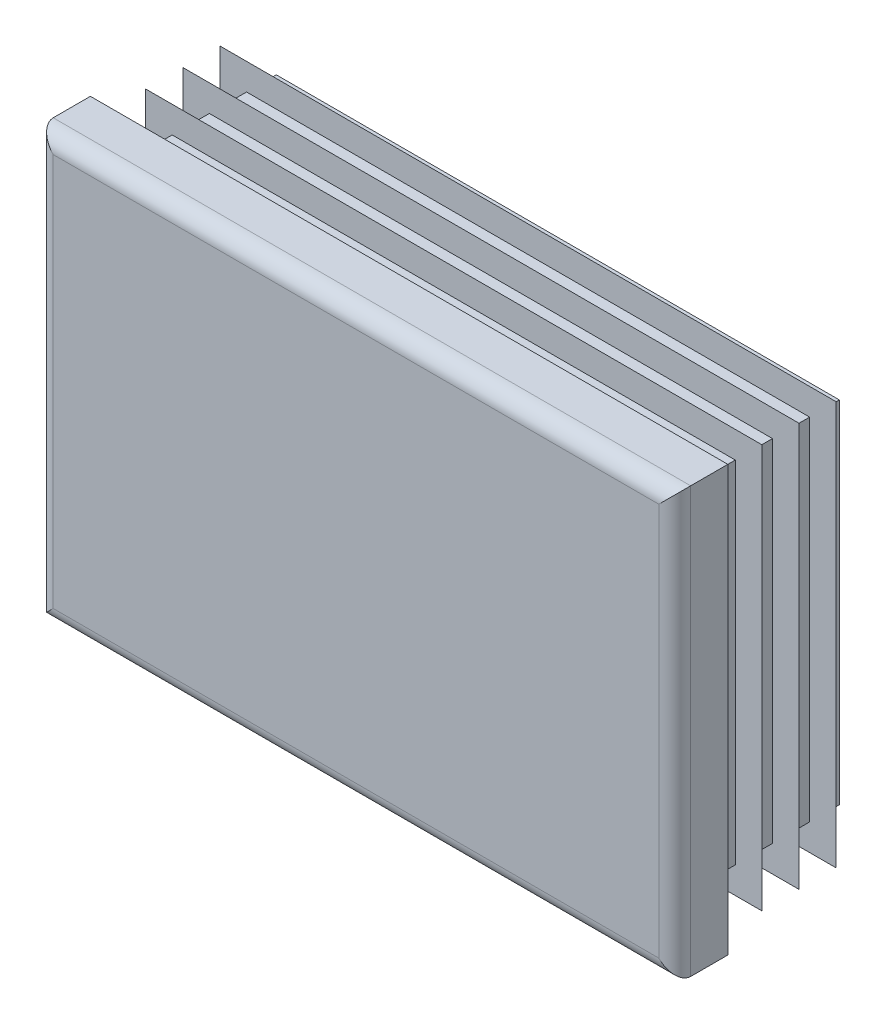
ISO-10303-21;
HEADER;
FILE_DESCRIPTION(('STEP AP214'),'2;1');
FILE_NAME('part.step','',(''),(''),'','','');
FILE_SCHEMA(('AUTOMOTIVE_DESIGN { 1 0 10303 214 1 1 1 1 }'));
ENDSEC;
DATA;
#1=APPLICATION_CONTEXT('core data for automotive mechanical design processes');
#2=APPLICATION_PROTOCOL_DEFINITION('international standard','automotive_design',2000,#1);
#3=PRODUCT_CONTEXT('',#1,'mechanical');
#4=PRODUCT('Part','Part','',(#3));
#5=PRODUCT_RELATED_PRODUCT_CATEGORY('part','',(#4));
#6=PRODUCT_DEFINITION_FORMATION('','',#4);
#7=PRODUCT_DEFINITION_CONTEXT('part definition',#1,'design');
#8=PRODUCT_DEFINITION('design','',#6,#7);
#9=PRODUCT_DEFINITION_SHAPE('','',#8);
#10=(LENGTH_UNIT() NAMED_UNIT(*) SI_UNIT(.MILLI.,.METRE.));
#11=(NAMED_UNIT(*) PLANE_ANGLE_UNIT() SI_UNIT($,.RADIAN.));
#12=(NAMED_UNIT(*) SI_UNIT($,.STERADIAN.) SOLID_ANGLE_UNIT());
#13=UNCERTAINTY_MEASURE_WITH_UNIT(LENGTH_MEASURE(1.E-05),#10,'distance_accuracy_value','');
#14=(GEOMETRIC_REPRESENTATION_CONTEXT(3) GLOBAL_UNCERTAINTY_ASSIGNED_CONTEXT((#13)) GLOBAL_UNIT_ASSIGNED_CONTEXT((#10,
#11,#12)) REPRESENTATION_CONTEXT('',''));
#15=CARTESIAN_POINT('',(0.,0.,0.));
#16=DIRECTION('',(0.,0.,1.));
#17=DIRECTION('',(1.,0.,0.));
#18=AXIS2_PLACEMENT_3D('',#15,#16,#17);
#19=CARTESIAN_POINT('',(28.5,-20.,5.));
#20=DIRECTION('',(0.,0.,-1.));
#21=DIRECTION('',(0.,1.,0.));
#22=AXIS2_PLACEMENT_3D('',#19,#20,#21);
#23=PLANE('',#22);
#24=DIRECTION('',(0.,1.,0.));
#25=VECTOR('',#24,1.);
#26=CARTESIAN_POINT('',(-28.5,-20.,5.));
#27=LINE('',#26,#25);
#28=CARTESIAN_POINT('',(-28.5,-18.5,5.));
#29=VERTEX_POINT('',#28);
#30=CARTESIAN_POINT('',(-28.5,18.5,5.));
#31=VERTEX_POINT('',#30);
#32=EDGE_CURVE('E310',#29,#31,#27,.T.);
#33=ORIENTED_EDGE('',*,*,#32,.F.);
#34=DIRECTION('',(-1.,0.,0.));
#35=VECTOR('',#34,1.);
#36=CARTESIAN_POINT('',(30.,-18.5,5.));
#37=LINE('',#36,#35);
#38=CARTESIAN_POINT('',(28.5,-18.5,5.));
#39=VERTEX_POINT('',#38);
#40=EDGE_CURVE('E482',#39,#29,#37,.T.);
#41=ORIENTED_EDGE('',*,*,#40,.F.);
#42=DIRECTION('',(0.,1.,0.));
#43=VECTOR('',#42,1.);
#44=CARTESIAN_POINT('',(28.5,-20.,5.));
#45=LINE('',#44,#43);
#46=CARTESIAN_POINT('',(28.5,18.5,5.));
#47=VERTEX_POINT('',#46);
#48=EDGE_CURVE('E305',#39,#47,#45,.T.);
#49=ORIENTED_EDGE('',*,*,#48,.T.);
#50=DIRECTION('',(-1.,0.,0.));
#51=VECTOR('',#50,1.);
#52=CARTESIAN_POINT('',(30.,18.5,5.));
#53=LINE('',#52,#51);
#54=EDGE_CURVE('E630',#47,#31,#53,.T.);
#55=ORIENTED_EDGE('',*,*,#54,.T.);
#56=EDGE_LOOP('',(#33,#41,#49,#55));
#57=FACE_BOUND('',#56,.T.);
#58=ADVANCED_FACE('F14',(#57),#23,.F.);
#59=CARTESIAN_POINT('',(-28.5,-20.,3.5));
#60=DIRECTION('',(0.,1.,0.));
#61=DIRECTION('',(-1.,0.,0.));
#62=AXIS2_PLACEMENT_3D('',#59,#60,#61);
#63=CYLINDRICAL_SURFACE('',#62,1.5);
#64=DIRECTION('',(0.,1.,0.));
#65=VECTOR('',#64,1.);
#66=CARTESIAN_POINT('',(-30.,-20.,3.5));
#67=LINE('',#66,#65);
#68=CARTESIAN_POINT('',(-30.,-20.,3.5));
#69=VERTEX_POINT('',#68);
#70=CARTESIAN_POINT('',(-30.,20.,3.5));
#71=VERTEX_POINT('',#70);
#72=EDGE_CURVE('E402',#69,#71,#67,.T.);
#73=ORIENTED_EDGE('',*,*,#72,.F.);
#74=CARTESIAN_POINT('',(-28.5,-18.5,3.5));
#75=DIRECTION('',(-0.707106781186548,0.707106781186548,0.));
#76=DIRECTION('',(0.707106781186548,0.707106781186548,0.));
#77=AXIS2_PLACEMENT_3D('',#74,#75,#76);
#78=ELLIPSE('',#77,2.12132034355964,1.5);
#79=EDGE_CURVE('E59',#69,#29,#78,.T.);
#80=ORIENTED_EDGE('',*,*,#79,.T.);
#81=ORIENTED_EDGE('',*,*,#32,.T.);
#82=CARTESIAN_POINT('',(-28.5,18.5,3.5));
#83=DIRECTION('',(0.707106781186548,0.707106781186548,0.));
#84=DIRECTION('',(-0.707106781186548,0.707106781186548,0.));
#85=AXIS2_PLACEMENT_3D('',#82,#83,#84);
#86=ELLIPSE('',#85,2.12132034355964,1.5);
#87=EDGE_CURVE('E306',#31,#71,#86,.F.);
#88=ORIENTED_EDGE('',*,*,#87,.T.);
#89=EDGE_LOOP('',(#73,#80,#81,#88));
#90=FACE_BOUND('',#89,.T.);
#91=ADVANCED_FACE('F16',(#90),#63,.T.);
#92=CARTESIAN_POINT('',(-30.,-20.,3.5));
#93=DIRECTION('',(1.,0.,0.));
#94=DIRECTION('',(0.,1.,0.));
#95=AXIS2_PLACEMENT_3D('',#92,#93,#94);
#96=PLANE('',#95);
#97=DIRECTION('',(0.,0.,-1.));
#98=VECTOR('',#97,1.);
#99=CARTESIAN_POINT('',(-30.,20.,3.5));
#100=LINE('',#99,#98);
#101=CARTESIAN_POINT('',(-30.,20.,0.));
#102=VERTEX_POINT('',#101);
#103=EDGE_CURVE('E615',#71,#102,#100,.T.);
#104=ORIENTED_EDGE('',*,*,#103,.T.);
#105=DIRECTION('',(0.,1.,0.));
#106=VECTOR('',#105,1.);
#107=CARTESIAN_POINT('',(-30.,-20.,0.));
#108=LINE('',#107,#106);
#109=CARTESIAN_POINT('',(-30.,-20.,0.));
#110=VERTEX_POINT('',#109);
#111=EDGE_CURVE('E400',#110,#102,#108,.T.);
#112=ORIENTED_EDGE('',*,*,#111,.F.);
#113=DIRECTION('',(0.,0.,-1.));
#114=VECTOR('',#113,1.);
#115=CARTESIAN_POINT('',(-30.,-20.,3.5));
#116=LINE('',#115,#114);
#117=EDGE_CURVE('E616',#69,#110,#116,.T.);
#118=ORIENTED_EDGE('',*,*,#117,.F.);
#119=ORIENTED_EDGE('',*,*,#72,.T.);
#120=EDGE_LOOP('',(#104,#112,#118,#119));
#121=FACE_BOUND('',#120,.T.);
#122=ADVANCED_FACE('F697',(#121),#96,.F.);
#123=CARTESIAN_POINT('',(-26.5,-20.,0.));
#124=DIRECTION('',(1.,0.,0.));
#125=DIRECTION('',(0.,1.,0.));
#126=AXIS2_PLACEMENT_3D('',#123,#124,#125);
#127=PLANE('',#126);
#128=DIRECTION('',(0.,1.,0.));
#129=VECTOR('',#128,1.);
#130=CARTESIAN_POINT('',(-26.5,-20.,0.));
#131=LINE('',#130,#129);
#132=CARTESIAN_POINT('',(-26.5,-16.5,0.));
#133=VERTEX_POINT('',#132);
#134=CARTESIAN_POINT('',(-26.5,16.5,0.));
#135=VERTEX_POINT('',#134);
#136=EDGE_CURVE('E397',#133,#135,#131,.T.);
#137=ORIENTED_EDGE('',*,*,#136,.T.);
#138=DIRECTION('',(0.,0.,-1.));
#139=VECTOR('',#138,1.);
#140=CARTESIAN_POINT('',(-26.5,16.5,0.));
#141=LINE('',#140,#139);
#142=CARTESIAN_POINT('',(-26.5,16.5,-0.7));
#143=VERTEX_POINT('',#142);
#144=EDGE_CURVE('E495',#135,#143,#141,.T.);
#145=ORIENTED_EDGE('',*,*,#144,.T.);
#146=DIRECTION('',(0.,1.,0.));
#147=VECTOR('',#146,1.);
#148=CARTESIAN_POINT('',(-26.5,-20.,-0.7));
#149=LINE('',#148,#147);
#150=CARTESIAN_POINT('',(-26.5,-16.5,-0.7));
#151=VERTEX_POINT('',#150);
#152=EDGE_CURVE('E394',#151,#143,#149,.T.);
#153=ORIENTED_EDGE('',*,*,#152,.F.);
#154=DIRECTION('',(0.,0.,1.));
#155=VECTOR('',#154,1.);
#156=CARTESIAN_POINT('',(-26.5,-16.5,0.));
#157=LINE('',#156,#155);
#158=EDGE_CURVE('E489',#151,#133,#157,.T.);
#159=ORIENTED_EDGE('',*,*,#158,.T.);
#160=EDGE_LOOP('',(#137,#145,#153,#159));
#161=FACE_BOUND('',#160,.T.);
#162=ADVANCED_FACE('F787',(#161),#127,.F.);
#163=CARTESIAN_POINT('',(-29.,-20.,-0.7));
#164=DIRECTION('',(0.342020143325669,0.,0.939692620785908));
#165=DIRECTION('',(-0.939692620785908,0.,0.342020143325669));
#166=AXIS2_PLACEMENT_3D('',#163,#164,#165);
#167=PLANE('',#166);
#168=DIRECTION('',(0.,1.,0.));
#169=VECTOR('',#168,1.);
#170=CARTESIAN_POINT('',(-29.,-20.,-0.7));
#171=LINE('',#170,#169);
#172=CARTESIAN_POINT('',(-29.,-19.,-0.7));
#173=VERTEX_POINT('',#172);
#174=CARTESIAN_POINT('',(-29.,19.,-0.7));
#175=VERTEX_POINT('',#174);
#176=EDGE_CURVE('E392',#173,#175,#171,.T.);
#177=ORIENTED_EDGE('',*,*,#176,.T.);
#178=DIRECTION('',(0.844349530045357,-0.438895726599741,-0.307318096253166));
#179=VECTOR('',#178,1.);
#180=CARTESIAN_POINT('',(-14.5473253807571,11.4874511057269,-5.96034336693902));
#181=LINE('',#180,#179);
#182=CARTESIAN_POINT('',(-26.5,17.7004915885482,-1.60992558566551));
#183=VERTEX_POINT('',#182);
#184=EDGE_CURVE('E519',#175,#183,#181,.T.);
#185=ORIENTED_EDGE('',*,*,#184,.T.);
#186=DIRECTION('',(0.,1.,0.));
#187=VECTOR('',#186,1.);
#188=CARTESIAN_POINT('',(-26.5,-20.,-1.60992558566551));
#189=LINE('',#188,#187);
#190=CARTESIAN_POINT('',(-26.5,-17.7004915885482,-1.60992558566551));
#191=VERTEX_POINT('',#190);
#192=EDGE_CURVE('E389',#191,#183,#189,.T.);
#193=ORIENTED_EDGE('',*,*,#192,.F.);
#194=DIRECTION('',(-0.844349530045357,-0.438895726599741,0.307318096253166));
#195=VECTOR('',#194,1.);
#196=CARTESIAN_POINT('',(-29.3705814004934,-19.1926294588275,-0.565119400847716));
#197=LINE('',#196,#195);
#198=EDGE_CURVE('E507',#191,#173,#197,.T.);
#199=ORIENTED_EDGE('',*,*,#198,.T.);
#200=EDGE_LOOP('',(#177,#185,#193,#199));
#201=FACE_BOUND('',#200,.T.);
#202=ADVANCED_FACE('F783',(#201),#167,.F.);
#203=CARTESIAN_POINT('',(-26.5,-20.,-1.60992558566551));
#204=DIRECTION('',(1.,0.,0.));
#205=DIRECTION('',(0.,1.,0.));
#206=AXIS2_PLACEMENT_3D('',#203,#204,#205);
#207=PLANE('',#206);
#208=ORIENTED_EDGE('',*,*,#192,.T.);
#209=DIRECTION('',(0.,-0.819152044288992,-0.573576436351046));
#210=VECTOR('',#209,1.);
#211=CARTESIAN_POINT('',(-26.5,-7.59691797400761,-19.3233624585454));
#212=LINE('',#211,#210);
#213=CARTESIAN_POINT('',(-26.5,16.5,-2.45051884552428));
#214=VERTEX_POINT('',#213);
#215=EDGE_CURVE('E516',#183,#214,#212,.T.);
#216=ORIENTED_EDGE('',*,*,#215,.T.);
#217=DIRECTION('',(0.,0.,-1.));
#218=VECTOR('',#217,1.);
#219=CARTESIAN_POINT('',(-26.5,16.5,-1.60992558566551));
#220=LINE('',#219,#218);
#221=CARTESIAN_POINT('',(-26.5,16.5,-4.2));
#222=VERTEX_POINT('',#221);
#223=EDGE_CURVE('E525',#214,#222,#220,.T.);
#224=ORIENTED_EDGE('',*,*,#223,.T.);
#225=DIRECTION('',(0.,1.,0.));
#226=VECTOR('',#225,1.);
#227=CARTESIAN_POINT('',(-26.5,-20.,-4.2));
#228=LINE('',#227,#226);
#229=CARTESIAN_POINT('',(-26.5,-16.5,-4.2));
#230=VERTEX_POINT('',#229);
#231=EDGE_CURVE('E386',#230,#222,#228,.T.);
#232=ORIENTED_EDGE('',*,*,#231,.F.);
#233=DIRECTION('',(0.,0.,1.));
#234=VECTOR('',#233,1.);
#235=CARTESIAN_POINT('',(-26.5,-16.5,-1.60992558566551));
#236=LINE('',#235,#234);
#237=CARTESIAN_POINT('',(-26.5,-16.5,-2.45051884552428));
#238=VERTEX_POINT('',#237);
#239=EDGE_CURVE('E522',#230,#238,#236,.T.);
#240=ORIENTED_EDGE('',*,*,#239,.T.);
#241=DIRECTION('',(0.,-0.819152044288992,0.573576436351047));
#242=VECTOR('',#241,1.);
#243=CARTESIAN_POINT('',(-26.5,-19.2434848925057,-0.529510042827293));
#244=LINE('',#243,#242);
#245=EDGE_CURVE('E504',#238,#191,#244,.T.);
#246=ORIENTED_EDGE('',*,*,#245,.T.);
#247=EDGE_LOOP('',(#208,#216,#224,#232,#240,#246));
#248=FACE_BOUND('',#247,.T.);
#249=ADVANCED_FACE('F779',(#248),#207,.F.);
#250=CARTESIAN_POINT('',(-29.,-20.,-4.2));
#251=DIRECTION('',(0.342020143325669,0.,0.939692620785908));
#252=DIRECTION('',(-0.939692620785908,0.,0.342020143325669));
#253=AXIS2_PLACEMENT_3D('',#250,#251,#252);
#254=PLANE('',#253);
#255=DIRECTION('',(0.,1.,0.));
#256=VECTOR('',#255,1.);
#257=CARTESIAN_POINT('',(-29.,-20.,-4.2));
#258=LINE('',#257,#256);
#259=CARTESIAN_POINT('',(-29.,-19.,-4.2));
#260=VERTEX_POINT('',#259);
#261=CARTESIAN_POINT('',(-29.,19.,-4.2));
#262=VERTEX_POINT('',#261);
#263=EDGE_CURVE('E384',#260,#262,#258,.T.);
#264=ORIENTED_EDGE('',*,*,#263,.T.);
#265=DIRECTION('',(0.844349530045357,-0.438895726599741,-0.307318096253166));
#266=VECTOR('',#265,1.);
#267=CARTESIAN_POINT('',(-14.5473253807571,11.4874511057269,-9.46034336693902));
#268=LINE('',#267,#266);
#269=CARTESIAN_POINT('',(-26.5,17.7004915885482,-5.1099255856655));
#270=VERTEX_POINT('',#269);
#271=EDGE_CURVE('E549',#262,#270,#268,.T.);
#272=ORIENTED_EDGE('',*,*,#271,.T.);
#273=DIRECTION('',(0.,1.,0.));
#274=VECTOR('',#273,1.);
#275=CARTESIAN_POINT('',(-26.5,-20.,-5.1099255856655));
#276=LINE('',#275,#274);
#277=CARTESIAN_POINT('',(-26.5,-17.7004915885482,-5.1099255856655));
#278=VERTEX_POINT('',#277);
#279=EDGE_CURVE('E381',#278,#270,#276,.T.);
#280=ORIENTED_EDGE('',*,*,#279,.F.);
#281=DIRECTION('',(-0.844349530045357,-0.43889572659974,0.307318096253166));
#282=VECTOR('',#281,1.);
#283=CARTESIAN_POINT('',(-29.3705814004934,-19.1926294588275,-4.06511940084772));
#284=LINE('',#283,#282);
#285=EDGE_CURVE('E537',#278,#260,#284,.T.);
#286=ORIENTED_EDGE('',*,*,#285,.T.);
#287=EDGE_LOOP('',(#264,#272,#280,#286));
#288=FACE_BOUND('',#287,.T.);
#289=ADVANCED_FACE('F775',(#288),#254,.F.);
#290=CARTESIAN_POINT('',(-26.5,-20.,-5.1099255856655));
#291=DIRECTION('',(1.,0.,0.));
#292=DIRECTION('',(0.,1.,0.));
#293=AXIS2_PLACEMENT_3D('',#290,#291,#292);
#294=PLANE('',#293);
#295=ORIENTED_EDGE('',*,*,#279,.T.);
#296=DIRECTION('',(0.,-0.819152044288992,-0.573576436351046));
#297=VECTOR('',#296,1.);
#298=CARTESIAN_POINT('',(-26.5,-7.59691797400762,-22.8233624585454));
#299=LINE('',#298,#297);
#300=CARTESIAN_POINT('',(-26.5,16.5,-5.95051884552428));
#301=VERTEX_POINT('',#300);
#302=EDGE_CURVE('E546',#270,#301,#299,.T.);
#303=ORIENTED_EDGE('',*,*,#302,.T.);
#304=DIRECTION('',(0.,0.,-1.));
#305=VECTOR('',#304,1.);
#306=CARTESIAN_POINT('',(-26.5,16.5,-5.1099255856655));
#307=LINE('',#306,#305);
#308=CARTESIAN_POINT('',(-26.5,16.5,-7.7));
#309=VERTEX_POINT('',#308);
#310=EDGE_CURVE('E555',#301,#309,#307,.T.);
#311=ORIENTED_EDGE('',*,*,#310,.T.);
#312=DIRECTION('',(0.,1.,0.));
#313=VECTOR('',#312,1.);
#314=CARTESIAN_POINT('',(-26.5,-20.,-7.7));
#315=LINE('',#314,#313);
#316=CARTESIAN_POINT('',(-26.5,-16.5,-7.7));
#317=VERTEX_POINT('',#316);
#318=EDGE_CURVE('E378',#317,#309,#315,.T.);
#319=ORIENTED_EDGE('',*,*,#318,.F.);
#320=DIRECTION('',(0.,0.,1.));
#321=VECTOR('',#320,1.);
#322=CARTESIAN_POINT('',(-26.5,-16.5,-5.1099255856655));
#323=LINE('',#322,#321);
#324=CARTESIAN_POINT('',(-26.5,-16.5,-5.95051884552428));
#325=VERTEX_POINT('',#324);
#326=EDGE_CURVE('E552',#317,#325,#323,.T.);
#327=ORIENTED_EDGE('',*,*,#326,.T.);
#328=DIRECTION('',(0.,-0.819152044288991,0.573576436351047));
#329=VECTOR('',#328,1.);
#330=CARTESIAN_POINT('',(-26.5,-19.2434848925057,-4.02951004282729));
#331=LINE('',#330,#329);
#332=EDGE_CURVE('E534',#325,#278,#331,.T.);
#333=ORIENTED_EDGE('',*,*,#332,.T.);
#334=EDGE_LOOP('',(#295,#303,#311,#319,#327,#333));
#335=FACE_BOUND('',#334,.T.);
#336=ADVANCED_FACE('F771',(#335),#294,.F.);
#337=CARTESIAN_POINT('',(-29.,-20.,-7.7));
#338=DIRECTION('',(0.34202014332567,0.,0.939692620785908));
#339=DIRECTION('',(-0.939692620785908,0.,0.34202014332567));
#340=AXIS2_PLACEMENT_3D('',#337,#338,#339);
#341=PLANE('',#340);
#342=DIRECTION('',(0.,1.,0.));
#343=VECTOR('',#342,1.);
#344=CARTESIAN_POINT('',(-29.,-20.,-7.7));
#345=LINE('',#344,#343);
#346=CARTESIAN_POINT('',(-29.,-19.,-7.7));
#347=VERTEX_POINT('',#346);
#348=CARTESIAN_POINT('',(-29.,19.,-7.7));
#349=VERTEX_POINT('',#348);
#350=EDGE_CURVE('E376',#347,#349,#345,.T.);
#351=ORIENTED_EDGE('',*,*,#350,.T.);
#352=DIRECTION('',(0.844349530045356,-0.438895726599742,-0.307318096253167));
#353=VECTOR('',#352,1.);
#354=CARTESIAN_POINT('',(-14.5473253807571,11.4874511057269,-12.960343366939));
#355=LINE('',#354,#353);
#356=CARTESIAN_POINT('',(-26.5,17.7004915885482,-8.60992558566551));
#357=VERTEX_POINT('',#356);
#358=EDGE_CURVE('E579',#349,#357,#355,.T.);
#359=ORIENTED_EDGE('',*,*,#358,.T.);
#360=DIRECTION('',(0.,1.,0.));
#361=VECTOR('',#360,1.);
#362=CARTESIAN_POINT('',(-26.5,-20.,-8.60992558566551));
#363=LINE('',#362,#361);
#364=CARTESIAN_POINT('',(-26.5,-17.7004915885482,-8.60992558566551));
#365=VERTEX_POINT('',#364);
#366=EDGE_CURVE('E373',#365,#357,#363,.T.);
#367=ORIENTED_EDGE('',*,*,#366,.F.);
#368=DIRECTION('',(-0.844349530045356,-0.438895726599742,0.307318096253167));
#369=VECTOR('',#368,1.);
#370=CARTESIAN_POINT('',(-29.3705814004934,-19.1926294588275,-7.56511940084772));
#371=LINE('',#370,#369);
#372=EDGE_CURVE('E567',#365,#347,#371,.T.);
#373=ORIENTED_EDGE('',*,*,#372,.T.);
#374=EDGE_LOOP('',(#351,#359,#367,#373));
#375=FACE_BOUND('',#374,.T.);
#376=ADVANCED_FACE('F767',(#375),#341,.F.);
#377=CARTESIAN_POINT('',(-26.5,-20.,-8.60992558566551));
#378=DIRECTION('',(1.,0.,0.));
#379=DIRECTION('',(0.,1.,0.));
#380=AXIS2_PLACEMENT_3D('',#377,#378,#379);
#381=PLANE('',#380);
#382=ORIENTED_EDGE('',*,*,#366,.T.);
#383=DIRECTION('',(0.,-0.819152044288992,-0.573576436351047));
#384=VECTOR('',#383,1.);
#385=CARTESIAN_POINT('',(-26.5,-7.59691797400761,-26.3233624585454));
#386=LINE('',#385,#384);
#387=CARTESIAN_POINT('',(-26.5,16.5,-9.45051884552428));
#388=VERTEX_POINT('',#387);
#389=EDGE_CURVE('E576',#357,#388,#386,.T.);
#390=ORIENTED_EDGE('',*,*,#389,.T.);
#391=DIRECTION('',(0.,0.,-1.));
#392=VECTOR('',#391,1.);
#393=CARTESIAN_POINT('',(-26.5,16.5,-8.60992558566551));
#394=LINE('',#393,#392);
#395=CARTESIAN_POINT('',(-26.5,16.5,-11.2));
#396=VERTEX_POINT('',#395);
#397=EDGE_CURVE('E585',#388,#396,#394,.T.);
#398=ORIENTED_EDGE('',*,*,#397,.T.);
#399=DIRECTION('',(0.,1.,0.));
#400=VECTOR('',#399,1.);
#401=CARTESIAN_POINT('',(-26.5,-20.,-11.2));
#402=LINE('',#401,#400);
#403=CARTESIAN_POINT('',(-26.5,-16.5,-11.2));
#404=VERTEX_POINT('',#403);
#405=EDGE_CURVE('E370',#404,#396,#402,.T.);
#406=ORIENTED_EDGE('',*,*,#405,.F.);
#407=DIRECTION('',(0.,0.,1.));
#408=VECTOR('',#407,1.);
#409=CARTESIAN_POINT('',(-26.5,-16.5,-8.60992558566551));
#410=LINE('',#409,#408);
#411=CARTESIAN_POINT('',(-26.5,-16.5,-9.45051884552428));
#412=VERTEX_POINT('',#411);
#413=EDGE_CURVE('E582',#404,#412,#410,.T.);
#414=ORIENTED_EDGE('',*,*,#413,.T.);
#415=DIRECTION('',(0.,-0.819152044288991,0.573576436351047));
#416=VECTOR('',#415,1.);
#417=CARTESIAN_POINT('',(-26.5,-19.2434848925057,-7.52951004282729));
#418=LINE('',#417,#416);
#419=EDGE_CURVE('E564',#412,#365,#418,.T.);
#420=ORIENTED_EDGE('',*,*,#419,.T.);
#421=EDGE_LOOP('',(#382,#390,#398,#406,#414,#420));
#422=FACE_BOUND('',#421,.T.);
#423=ADVANCED_FACE('F764',(#422),#381,.F.);
#424=CARTESIAN_POINT('',(-29.,-20.,-11.2));
#425=DIRECTION('',(0.342020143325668,0.,0.939692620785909));
#426=DIRECTION('',(-0.939692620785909,0.,0.342020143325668));
#427=AXIS2_PLACEMENT_3D('',#424,#425,#426);
#428=PLANE('',#427);
#429=DIRECTION('',(0.,1.,0.));
#430=VECTOR('',#429,1.);
#431=CARTESIAN_POINT('',(-29.,-20.,-11.2));
#432=LINE('',#431,#430);
#433=CARTESIAN_POINT('',(-29.,-19.,-11.2));
#434=VERTEX_POINT('',#433);
#435=CARTESIAN_POINT('',(-29.,19.,-11.2));
#436=VERTEX_POINT('',#435);
#437=EDGE_CURVE('E368',#434,#436,#432,.T.);
#438=ORIENTED_EDGE('',*,*,#437,.T.);
#439=DIRECTION('',(0.844349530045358,-0.43889572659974,-0.307318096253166));
#440=VECTOR('',#439,1.);
#441=CARTESIAN_POINT('',(-14.5473253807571,11.487451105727,-16.460343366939));
#442=LINE('',#441,#440);
#443=CARTESIAN_POINT('',(-26.5,17.7004915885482,-12.1099255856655));
#444=VERTEX_POINT('',#443);
#445=EDGE_CURVE('E607',#436,#444,#442,.T.);
#446=ORIENTED_EDGE('',*,*,#445,.T.);
#447=DIRECTION('',(0.,1.,0.));
#448=VECTOR('',#447,1.);
#449=CARTESIAN_POINT('',(-26.5,-20.,-12.1099255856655));
#450=LINE('',#449,#448);
#451=CARTESIAN_POINT('',(-26.5,-17.7004915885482,-12.1099255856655));
#452=VERTEX_POINT('',#451);
#453=EDGE_CURVE('E365',#452,#444,#450,.T.);
#454=ORIENTED_EDGE('',*,*,#453,.F.);
#455=DIRECTION('',(-0.844349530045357,-0.438895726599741,0.307318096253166));
#456=VECTOR('',#455,1.);
#457=CARTESIAN_POINT('',(-29.3705814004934,-19.1926294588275,-11.0651194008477));
#458=LINE('',#457,#456);
#459=EDGE_CURVE('E595',#452,#434,#458,.T.);
#460=ORIENTED_EDGE('',*,*,#459,.T.);
#461=EDGE_LOOP('',(#438,#446,#454,#460));
#462=FACE_BOUND('',#461,.T.);
#463=ADVANCED_FACE('F675',(#462),#428,.F.);
#464=CARTESIAN_POINT('',(-26.5,-20.,-12.1099255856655));
#465=DIRECTION('',(1.,0.,0.));
#466=DIRECTION('',(0.,1.,0.));
#467=AXIS2_PLACEMENT_3D('',#464,#465,#466);
#468=PLANE('',#467);
#469=ORIENTED_EDGE('',*,*,#453,.T.);
#470=DIRECTION('',(0.,-0.819152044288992,-0.573576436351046));
#471=VECTOR('',#470,1.);
#472=CARTESIAN_POINT('',(-26.5,-7.59691797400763,-29.8233624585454));
#473=LINE('',#472,#471);
#474=CARTESIAN_POINT('',(-26.5,16.5,-12.9505188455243));
#475=VERTEX_POINT('',#474);
#476=EDGE_CURVE('E604',#444,#475,#473,.T.);
#477=ORIENTED_EDGE('',*,*,#476,.T.);
#478=DIRECTION('',(0.,0.,-1.));
#479=VECTOR('',#478,1.);
#480=CARTESIAN_POINT('',(-26.5,16.5,-12.1099255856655));
#481=LINE('',#480,#479);
#482=CARTESIAN_POINT('',(-26.5,16.5,-14.));
#483=VERTEX_POINT('',#482);
#484=EDGE_CURVE('E613',#475,#483,#481,.T.);
#485=ORIENTED_EDGE('',*,*,#484,.T.);
#486=DIRECTION('',(0.,1.,0.));
#487=VECTOR('',#486,1.);
#488=CARTESIAN_POINT('',(-26.5,-20.,-14.));
#489=LINE('',#488,#487);
#490=CARTESIAN_POINT('',(-26.5,-16.5,-14.));
#491=VERTEX_POINT('',#490);
#492=EDGE_CURVE('E362',#491,#483,#489,.T.);
#493=ORIENTED_EDGE('',*,*,#492,.F.);
#494=DIRECTION('',(0.,0.,1.));
#495=VECTOR('',#494,1.);
#496=CARTESIAN_POINT('',(-26.5,-16.5,-12.1099255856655));
#497=LINE('',#496,#495);
#498=CARTESIAN_POINT('',(-26.5,-16.5,-12.9505188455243));
#499=VERTEX_POINT('',#498);
#500=EDGE_CURVE('E610',#491,#499,#497,.T.);
#501=ORIENTED_EDGE('',*,*,#500,.T.);
#502=DIRECTION('',(0.,-0.819152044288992,0.573576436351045));
#503=VECTOR('',#502,1.);
#504=CARTESIAN_POINT('',(-26.5,-19.2434848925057,-11.0295100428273));
#505=LINE('',#504,#503);
#506=EDGE_CURVE('E592',#499,#452,#505,.T.);
#507=ORIENTED_EDGE('',*,*,#506,.T.);
#508=EDGE_LOOP('',(#469,#477,#485,#493,#501,#507));
#509=FACE_BOUND('',#508,.T.);
#510=ADVANCED_FACE('F677',(#509),#468,.F.);
#511=CARTESIAN_POINT('',(-26.5,-20.,-14.));
#512=DIRECTION('',(0.,0.,1.));
#513=DIRECTION('',(0.,-1.,0.));
#514=AXIS2_PLACEMENT_3D('',#511,#512,#513);
#515=PLANE('',#514);
#516=ORIENTED_EDGE('',*,*,#492,.T.);
#517=DIRECTION('',(-1.,0.,0.));
#518=VECTOR('',#517,1.);
#519=CARTESIAN_POINT('',(30.,16.5,-14.));
#520=LINE('',#519,#518);
#521=CARTESIAN_POINT('',(26.5,16.5,-14.));
#522=VERTEX_POINT('',#521);
#523=EDGE_CURVE('E438',#522,#483,#520,.T.);
#524=ORIENTED_EDGE('',*,*,#523,.F.);
#525=DIRECTION('',(0.,1.,0.));
#526=VECTOR('',#525,1.);
#527=CARTESIAN_POINT('',(26.5,-20.,-14.));
#528=LINE('',#527,#526);
#529=CARTESIAN_POINT('',(26.5,-16.5,-14.));
#530=VERTEX_POINT('',#529);
#531=EDGE_CURVE('E359',#530,#522,#528,.T.);
#532=ORIENTED_EDGE('',*,*,#531,.F.);
#533=DIRECTION('',(-1.,0.,0.));
#534=VECTOR('',#533,1.);
#535=CARTESIAN_POINT('',(30.,-16.5,-14.));
#536=LINE('',#535,#534);
#537=EDGE_CURVE('E436',#530,#491,#536,.T.);
#538=ORIENTED_EDGE('',*,*,#537,.T.);
#539=EDGE_LOOP('',(#516,#524,#532,#538));
#540=FACE_BOUND('',#539,.T.);
#541=ADVANCED_FACE('F435',(#540),#515,.F.);
#542=CARTESIAN_POINT('',(26.5,-20.,-14.));
#543=DIRECTION('',(-1.,0.,0.));
#544=DIRECTION('',(0.,-1.,0.));
#545=AXIS2_PLACEMENT_3D('',#542,#543,#544);
#546=PLANE('',#545);
#547=DIRECTION('',(0.,0.,1.));
#548=VECTOR('',#547,1.);
#549=CARTESIAN_POINT('',(26.5,16.5,-14.));
#550=LINE('',#549,#548);
#551=CARTESIAN_POINT('',(26.5,16.5,-12.9505188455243));
#552=VERTEX_POINT('',#551);
#553=EDGE_CURVE('E9',#522,#552,#550,.T.);
#554=ORIENTED_EDGE('',*,*,#553,.T.);
#555=DIRECTION('',(0.,0.819152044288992,0.573576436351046));
#556=VECTOR('',#555,1.);
#557=CARTESIAN_POINT('',(26.5,-8.48496246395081,-30.4451779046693));
#558=LINE('',#557,#556);
#559=CARTESIAN_POINT('',(26.5,17.7004915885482,-12.1099255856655));
#560=VERTEX_POINT('',#559);
#561=EDGE_CURVE('E601',#552,#560,#558,.T.);
#562=ORIENTED_EDGE('',*,*,#561,.T.);
#563=DIRECTION('',(0.,1.,0.));
#564=VECTOR('',#563,1.);
#565=CARTESIAN_POINT('',(26.5,-20.,-12.1099255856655));
#566=LINE('',#565,#564);
#567=CARTESIAN_POINT('',(26.5,-17.7004915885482,-12.1099255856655));
#568=VERTEX_POINT('',#567);
#569=EDGE_CURVE('E356',#568,#560,#566,.T.);
#570=ORIENTED_EDGE('',*,*,#569,.F.);
#571=DIRECTION('',(0.,0.819152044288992,-0.573576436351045));
#572=VECTOR('',#571,1.);
#573=CARTESIAN_POINT('',(26.5,-18.3554404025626,-11.6513254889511));
#574=LINE('',#573,#572);
#575=CARTESIAN_POINT('',(26.5,-16.5,-12.9505188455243));
#576=VERTEX_POINT('',#575);
#577=EDGE_CURVE('E428',#568,#576,#574,.T.);
#578=ORIENTED_EDGE('',*,*,#577,.T.);
#579=DIRECTION('',(0.,0.,-1.));
#580=VECTOR('',#579,1.);
#581=CARTESIAN_POINT('',(26.5,-16.5,-14.));
#582=LINE('',#581,#580);
#583=EDGE_CURVE('E23',#576,#530,#582,.T.);
#584=ORIENTED_EDGE('',*,*,#583,.T.);
#585=ORIENTED_EDGE('',*,*,#531,.T.);
#586=EDGE_LOOP('',(#554,#562,#570,#578,#584,#585));
#587=FACE_BOUND('',#586,.T.);
#588=ADVANCED_FACE('F426',(#587),#546,.F.);
#589=CARTESIAN_POINT('',(26.5,-20.,-12.1099255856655));
#590=DIRECTION('',(-0.342020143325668,0.,0.939692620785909));
#591=DIRECTION('',(-0.939692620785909,0.,-0.342020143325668));
#592=AXIS2_PLACEMENT_3D('',#589,#590,#591);
#593=PLANE('',#592);
#594=ORIENTED_EDGE('',*,*,#569,.T.);
#595=DIRECTION('',(0.844349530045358,0.43889572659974,0.307318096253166));
#596=VECTOR('',#595,1.);
#597=CARTESIAN_POINT('',(12.5288990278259,10.4382662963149,-17.1949904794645));
#598=LINE('',#597,#596);
#599=CARTESIAN_POINT('',(29.,19.,-11.2));
#600=VERTEX_POINT('',#599);
#601=EDGE_CURVE('E598',#560,#600,#598,.T.);
#602=ORIENTED_EDGE('',*,*,#601,.T.);
#603=DIRECTION('',(0.,1.,0.));
#604=VECTOR('',#603,1.);
#605=CARTESIAN_POINT('',(29.,-20.,-11.2));
#606=LINE('',#605,#604);
#607=CARTESIAN_POINT('',(29.,-19.,-11.2));
#608=VERTEX_POINT('',#607);
#609=EDGE_CURVE('E353',#608,#600,#606,.T.);
#610=ORIENTED_EDGE('',*,*,#609,.F.);
#611=DIRECTION('',(-0.844349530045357,0.438895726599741,-0.307318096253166));
#612=VECTOR('',#611,1.);
#613=CARTESIAN_POINT('',(27.3521550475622,-18.1434446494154,-11.7997665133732));
#614=LINE('',#613,#612);
#615=EDGE_CURVE('E588',#608,#568,#614,.T.);
#616=ORIENTED_EDGE('',*,*,#615,.T.);
#617=EDGE_LOOP('',(#594,#602,#610,#616));
#618=FACE_BOUND('',#617,.T.);
#619=ADVANCED_FACE('F752',(#618),#593,.F.);
#620=CARTESIAN_POINT('',(29.,-20.,-11.2));
#621=DIRECTION('',(0.,0.,-1.));
#622=DIRECTION('',(0.,1.,0.));
#623=AXIS2_PLACEMENT_3D('',#620,#621,#622);
#624=PLANE('',#623);
#625=ORIENTED_EDGE('',*,*,#609,.T.);
#626=DIRECTION('',(-1.,0.,0.));
#627=VECTOR('',#626,1.);
#628=CARTESIAN_POINT('',(30.,19.,-11.2));
#629=LINE('',#628,#627);
#630=EDGE_CURVE('E444',#600,#436,#629,.T.);
#631=ORIENTED_EDGE('',*,*,#630,.T.);
#632=ORIENTED_EDGE('',*,*,#437,.F.);
#633=DIRECTION('',(-1.,0.,0.));
#634=VECTOR('',#633,1.);
#635=CARTESIAN_POINT('',(30.,-19.,-11.2));
#636=LINE('',#635,#634);
#637=EDGE_CURVE('E451',#608,#434,#636,.T.);
#638=ORIENTED_EDGE('',*,*,#637,.F.);
#639=EDGE_LOOP('',(#625,#631,#632,#638));
#640=FACE_BOUND('',#639,.T.);
#641=ORIENTED_EDGE('',*,*,#405,.T.);
#642=DIRECTION('',(-1.,0.,0.));
#643=VECTOR('',#642,1.);
#644=CARTESIAN_POINT('',(30.,16.5,-11.2));
#645=LINE('',#644,#643);
#646=CARTESIAN_POINT('',(26.5,16.5,-11.2));
#647=VERTEX_POINT('',#646);
#648=EDGE_CURVE('E663',#647,#396,#645,.T.);
#649=ORIENTED_EDGE('',*,*,#648,.F.);
#650=DIRECTION('',(0.,1.,0.));
#651=VECTOR('',#650,1.);
#652=CARTESIAN_POINT('',(26.5,-20.,-11.2));
#653=LINE('',#652,#651);
#654=CARTESIAN_POINT('',(26.5,-16.5,-11.2));
#655=VERTEX_POINT('',#654);
#656=EDGE_CURVE('E350',#655,#647,#653,.T.);
#657=ORIENTED_EDGE('',*,*,#656,.F.);
#658=DIRECTION('',(-1.,0.,0.));
#659=VECTOR('',#658,1.);
#660=CARTESIAN_POINT('',(30.,-16.5,-11.2));
#661=LINE('',#660,#659);
#662=EDGE_CURVE('E453',#655,#404,#661,.T.);
#663=ORIENTED_EDGE('',*,*,#662,.T.);
#664=EDGE_LOOP('',(#641,#649,#657,#663));
#665=FACE_BOUND('',#664,.T.);
#666=ADVANCED_FACE('F667',(#640,#665),#624,.F.);
#667=CARTESIAN_POINT('',(26.5,-20.,-11.2));
#668=DIRECTION('',(-1.,0.,0.));
#669=DIRECTION('',(0.,-1.,0.));
#670=AXIS2_PLACEMENT_3D('',#667,#668,#669);
#671=PLANE('',#670);
#672=DIRECTION('',(0.,0.,1.));
#673=VECTOR('',#672,1.);
#674=CARTESIAN_POINT('',(26.5,16.5,-11.2));
#675=LINE('',#674,#673);
#676=CARTESIAN_POINT('',(26.5,16.5,-9.45051884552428));
#677=VERTEX_POINT('',#676);
#678=EDGE_CURVE('E420',#647,#677,#675,.T.);
#679=ORIENTED_EDGE('',*,*,#678,.T.);
#680=DIRECTION('',(0.,0.819152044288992,0.573576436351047));
#681=VECTOR('',#680,1.);
#682=CARTESIAN_POINT('',(26.5,-8.81385488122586,-27.1754708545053));
#683=LINE('',#682,#681);
#684=CARTESIAN_POINT('',(26.5,17.7004915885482,-8.60992558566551));
#685=VERTEX_POINT('',#684);
#686=EDGE_CURVE('E573',#677,#685,#683,.T.);
#687=ORIENTED_EDGE('',*,*,#686,.T.);
#688=DIRECTION('',(0.,1.,0.));
#689=VECTOR('',#688,1.);
#690=CARTESIAN_POINT('',(26.5,-20.,-8.60992558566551));
#691=LINE('',#690,#689);
#692=CARTESIAN_POINT('',(26.5,-17.7004915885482,-8.60992558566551));
#693=VERTEX_POINT('',#692);
#694=EDGE_CURVE('E347',#693,#685,#691,.T.);
#695=ORIENTED_EDGE('',*,*,#694,.F.);
#696=DIRECTION('',(0.,0.819152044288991,-0.573576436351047));
#697=VECTOR('',#696,1.);
#698=CARTESIAN_POINT('',(26.5,-18.0265479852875,-8.38161843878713));
#699=LINE('',#698,#697);
#700=CARTESIAN_POINT('',(26.5,-16.5,-9.45051884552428));
#701=VERTEX_POINT('',#700);
#702=EDGE_CURVE('E561',#693,#701,#699,.T.);
#703=ORIENTED_EDGE('',*,*,#702,.T.);
#704=DIRECTION('',(0.,0.,-1.));
#705=VECTOR('',#704,1.);
#706=CARTESIAN_POINT('',(26.5,-16.5,-11.2));
#707=LINE('',#706,#705);
#708=EDGE_CURVE('E417',#701,#655,#707,.T.);
#709=ORIENTED_EDGE('',*,*,#708,.T.);
#710=ORIENTED_EDGE('',*,*,#656,.T.);
#711=EDGE_LOOP('',(#679,#687,#695,#703,#709,#710));
#712=FACE_BOUND('',#711,.T.);
#713=ADVANCED_FACE('F745',(#712),#671,.F.);
#714=CARTESIAN_POINT('',(26.5,-20.,-8.60992558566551));
#715=DIRECTION('',(-0.342020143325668,0.,0.939692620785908));
#716=DIRECTION('',(-0.939692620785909,0.,-0.342020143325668));
#717=AXIS2_PLACEMENT_3D('',#714,#715,#716);
#718=PLANE('',#717);
#719=ORIENTED_EDGE('',*,*,#694,.T.);
#720=DIRECTION('',(0.844349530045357,0.43889572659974,0.307318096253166));
#721=VECTOR('',#720,1.);
#722=CARTESIAN_POINT('',(12.5288990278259,10.4382662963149,-13.6949904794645));
#723=LINE('',#722,#721);
#724=CARTESIAN_POINT('',(29.,19.,-7.7));
#725=VERTEX_POINT('',#724);
#726=EDGE_CURVE('E570',#685,#725,#723,.T.);
#727=ORIENTED_EDGE('',*,*,#726,.T.);
#728=DIRECTION('',(0.,1.,0.));
#729=VECTOR('',#728,1.);
#730=CARTESIAN_POINT('',(29.,-20.,-7.7));
#731=LINE('',#730,#729);
#732=CARTESIAN_POINT('',(29.,-19.,-7.7));
#733=VERTEX_POINT('',#732);
#734=EDGE_CURVE('E344',#733,#725,#731,.T.);
#735=ORIENTED_EDGE('',*,*,#734,.F.);
#736=DIRECTION('',(-0.844349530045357,0.43889572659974,-0.307318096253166));
#737=VECTOR('',#736,1.);
#738=CARTESIAN_POINT('',(27.3521550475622,-18.1434446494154,-8.29976651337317));
#739=LINE('',#738,#737);
#740=EDGE_CURVE('E558',#733,#693,#739,.T.);
#741=ORIENTED_EDGE('',*,*,#740,.T.);
#742=EDGE_LOOP('',(#719,#727,#735,#741));
#743=FACE_BOUND('',#742,.T.);
#744=ADVANCED_FACE('F741',(#743),#718,.F.);
#745=CARTESIAN_POINT('',(29.,-20.,-7.7));
#746=DIRECTION('',(0.,0.,-1.));
#747=DIRECTION('',(0.,1.,0.));
#748=AXIS2_PLACEMENT_3D('',#745,#746,#747);
#749=PLANE('',#748);
#750=ORIENTED_EDGE('',*,*,#734,.T.);
#751=DIRECTION('',(-1.,0.,0.));
#752=VECTOR('',#751,1.);
#753=CARTESIAN_POINT('',(30.,19.,-7.7));
#754=LINE('',#753,#752);
#755=EDGE_CURVE('E657',#725,#349,#754,.T.);
#756=ORIENTED_EDGE('',*,*,#755,.T.);
#757=ORIENTED_EDGE('',*,*,#350,.F.);
#758=DIRECTION('',(-1.,0.,0.));
#759=VECTOR('',#758,1.);
#760=CARTESIAN_POINT('',(30.,-19.,-7.7));
#761=LINE('',#760,#759);
#762=EDGE_CURVE('E459',#733,#347,#761,.T.);
#763=ORIENTED_EDGE('',*,*,#762,.F.);
#764=EDGE_LOOP('',(#750,#756,#757,#763));
#765=FACE_BOUND('',#764,.T.);
#766=ORIENTED_EDGE('',*,*,#318,.T.);
#767=DIRECTION('',(-1.,0.,0.));
#768=VECTOR('',#767,1.);
#769=CARTESIAN_POINT('',(30.,16.5,-7.7));
#770=LINE('',#769,#768);
#771=CARTESIAN_POINT('',(26.5,16.5,-7.7));
#772=VERTEX_POINT('',#771);
#773=EDGE_CURVE('E655',#772,#309,#770,.T.);
#774=ORIENTED_EDGE('',*,*,#773,.F.);
#775=DIRECTION('',(0.,1.,0.));
#776=VECTOR('',#775,1.);
#777=CARTESIAN_POINT('',(26.5,-20.,-7.7));
#778=LINE('',#777,#776);
#779=CARTESIAN_POINT('',(26.5,-16.5,-7.7));
#780=VERTEX_POINT('',#779);
#781=EDGE_CURVE('E341',#780,#772,#778,.T.);
#782=ORIENTED_EDGE('',*,*,#781,.F.);
#783=DIRECTION('',(-1.,0.,0.));
#784=VECTOR('',#783,1.);
#785=CARTESIAN_POINT('',(30.,-16.5,-7.7));
#786=LINE('',#785,#784);
#787=EDGE_CURVE('E461',#780,#317,#786,.T.);
#788=ORIENTED_EDGE('',*,*,#787,.T.);
#789=EDGE_LOOP('',(#766,#774,#782,#788));
#790=FACE_BOUND('',#789,.T.);
#791=ADVANCED_FACE('F737',(#765,#790),#749,.F.);
#792=CARTESIAN_POINT('',(26.5,-20.,-7.7));
#793=DIRECTION('',(-1.,0.,0.));
#794=DIRECTION('',(0.,-1.,0.));
#795=AXIS2_PLACEMENT_3D('',#792,#793,#794);
#796=PLANE('',#795);
#797=DIRECTION('',(0.,0.,1.));
#798=VECTOR('',#797,1.);
#799=CARTESIAN_POINT('',(26.5,16.5,-7.7));
#800=LINE('',#799,#798);
#801=CARTESIAN_POINT('',(26.5,16.5,-5.95051884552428));
#802=VERTEX_POINT('',#801);
#803=EDGE_CURVE('E414',#772,#802,#800,.T.);
#804=ORIENTED_EDGE('',*,*,#803,.T.);
#805=DIRECTION('',(0.,0.819152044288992,0.573576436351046));
#806=VECTOR('',#805,1.);
#807=CARTESIAN_POINT('',(26.5,-8.81385488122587,-23.6754708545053));
#808=LINE('',#807,#806);
#809=CARTESIAN_POINT('',(26.5,17.7004915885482,-5.10992558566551));
#810=VERTEX_POINT('',#809);
#811=EDGE_CURVE('E543',#802,#810,#808,.T.);
#812=ORIENTED_EDGE('',*,*,#811,.T.);
#813=DIRECTION('',(0.,1.,0.));
#814=VECTOR('',#813,1.);
#815=CARTESIAN_POINT('',(26.5,-20.,-5.1099255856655));
#816=LINE('',#815,#814);
#817=CARTESIAN_POINT('',(26.5,-17.7004915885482,-5.1099255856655));
#818=VERTEX_POINT('',#817);
#819=EDGE_CURVE('E338',#818,#810,#816,.T.);
#820=ORIENTED_EDGE('',*,*,#819,.F.);
#821=DIRECTION('',(0.,0.819152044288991,-0.573576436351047));
#822=VECTOR('',#821,1.);
#823=CARTESIAN_POINT('',(26.5,-18.0265479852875,-4.88161843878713));
#824=LINE('',#823,#822);
#825=CARTESIAN_POINT('',(26.5,-16.5,-5.95051884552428));
#826=VERTEX_POINT('',#825);
#827=EDGE_CURVE('E531',#818,#826,#824,.T.);
#828=ORIENTED_EDGE('',*,*,#827,.T.);
#829=DIRECTION('',(0.,0.,-1.));
#830=VECTOR('',#829,1.);
#831=CARTESIAN_POINT('',(26.5,-16.5,-7.7));
#832=LINE('',#831,#830);
#833=EDGE_CURVE('E411',#826,#780,#832,.T.);
#834=ORIENTED_EDGE('',*,*,#833,.T.);
#835=ORIENTED_EDGE('',*,*,#781,.T.);
#836=EDGE_LOOP('',(#804,#812,#820,#828,#834,#835));
#837=FACE_BOUND('',#836,.T.);
#838=ADVANCED_FACE('F733',(#837),#796,.F.);
#839=CARTESIAN_POINT('',(26.5,-20.,-5.1099255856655));
#840=DIRECTION('',(-0.342020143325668,0.,0.939692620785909));
#841=DIRECTION('',(-0.939692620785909,0.,-0.342020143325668));
#842=AXIS2_PLACEMENT_3D('',#839,#840,#841);
#843=PLANE('',#842);
#844=ORIENTED_EDGE('',*,*,#819,.T.);
#845=DIRECTION('',(0.844349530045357,0.43889572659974,0.307318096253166));
#846=VECTOR('',#845,1.);
#847=CARTESIAN_POINT('',(12.5288990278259,10.4382662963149,-10.1949904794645));
#848=LINE('',#847,#846);
#849=CARTESIAN_POINT('',(29.,19.,-4.2));
#850=VERTEX_POINT('',#849);
#851=EDGE_CURVE('E540',#810,#850,#848,.T.);
#852=ORIENTED_EDGE('',*,*,#851,.T.);
#853=DIRECTION('',(0.,1.,0.));
#854=VECTOR('',#853,1.);
#855=CARTESIAN_POINT('',(29.,-20.,-4.2));
#856=LINE('',#855,#854);
#857=CARTESIAN_POINT('',(29.,-19.,-4.2));
#858=VERTEX_POINT('',#857);
#859=EDGE_CURVE('E335',#858,#850,#856,.T.);
#860=ORIENTED_EDGE('',*,*,#859,.F.);
#861=DIRECTION('',(-0.844349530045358,0.438895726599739,-0.307318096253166));
#862=VECTOR('',#861,1.);
#863=CARTESIAN_POINT('',(27.3521550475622,-18.1434446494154,-4.79976651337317));
#864=LINE('',#863,#862);
#865=EDGE_CURVE('E528',#858,#818,#864,.T.);
#866=ORIENTED_EDGE('',*,*,#865,.T.);
#867=EDGE_LOOP('',(#844,#852,#860,#866));
#868=FACE_BOUND('',#867,.T.);
#869=ADVANCED_FACE('F729',(#868),#843,.F.);
#870=CARTESIAN_POINT('',(29.,-20.,-4.2));
#871=DIRECTION('',(0.,0.,-1.));
#872=DIRECTION('',(0.,1.,0.));
#873=AXIS2_PLACEMENT_3D('',#870,#871,#872);
#874=PLANE('',#873);
#875=ORIENTED_EDGE('',*,*,#859,.T.);
#876=DIRECTION('',(-1.,0.,0.));
#877=VECTOR('',#876,1.);
#878=CARTESIAN_POINT('',(30.,19.,-4.2));
#879=LINE('',#878,#877);
#880=EDGE_CURVE('E649',#850,#262,#879,.T.);
#881=ORIENTED_EDGE('',*,*,#880,.T.);
#882=ORIENTED_EDGE('',*,*,#263,.F.);
#883=DIRECTION('',(-1.,0.,0.));
#884=VECTOR('',#883,1.);
#885=CARTESIAN_POINT('',(30.,-19.,-4.2));
#886=LINE('',#885,#884);
#887=EDGE_CURVE('E467',#858,#260,#886,.T.);
#888=ORIENTED_EDGE('',*,*,#887,.F.);
#889=EDGE_LOOP('',(#875,#881,#882,#888));
#890=FACE_BOUND('',#889,.T.);
#891=ORIENTED_EDGE('',*,*,#231,.T.);
#892=DIRECTION('',(-1.,0.,0.));
#893=VECTOR('',#892,1.);
#894=CARTESIAN_POINT('',(30.,16.5,-4.2));
#895=LINE('',#894,#893);
#896=CARTESIAN_POINT('',(26.5,16.5,-4.2));
#897=VERTEX_POINT('',#896);
#898=EDGE_CURVE('E647',#897,#222,#895,.T.);
#899=ORIENTED_EDGE('',*,*,#898,.F.);
#900=DIRECTION('',(0.,1.,0.));
#901=VECTOR('',#900,1.);
#902=CARTESIAN_POINT('',(26.5,-20.,-4.2));
#903=LINE('',#902,#901);
#904=CARTESIAN_POINT('',(26.5,-16.5,-4.2));
#905=VERTEX_POINT('',#904);
#906=EDGE_CURVE('E332',#905,#897,#903,.T.);
#907=ORIENTED_EDGE('',*,*,#906,.F.);
#908=DIRECTION('',(-1.,0.,0.));
#909=VECTOR('',#908,1.);
#910=CARTESIAN_POINT('',(30.,-16.5,-4.2));
#911=LINE('',#910,#909);
#912=EDGE_CURVE('E469',#905,#230,#911,.T.);
#913=ORIENTED_EDGE('',*,*,#912,.T.);
#914=EDGE_LOOP('',(#891,#899,#907,#913));
#915=FACE_BOUND('',#914,.T.);
#916=ADVANCED_FACE('F725',(#890,#915),#874,.F.);
#917=CARTESIAN_POINT('',(26.5,-20.,-4.2));
#918=DIRECTION('',(-1.,0.,0.));
#919=DIRECTION('',(0.,-1.,0.));
#920=AXIS2_PLACEMENT_3D('',#917,#918,#919);
#921=PLANE('',#920);
#922=DIRECTION('',(0.,0.,1.));
#923=VECTOR('',#922,1.);
#924=CARTESIAN_POINT('',(26.5,16.5,-4.2));
#925=LINE('',#924,#923);
#926=CARTESIAN_POINT('',(26.5,16.5,-2.45051884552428));
#927=VERTEX_POINT('',#926);
#928=EDGE_CURVE('E408',#897,#927,#925,.T.);
#929=ORIENTED_EDGE('',*,*,#928,.T.);
#930=DIRECTION('',(0.,0.819152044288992,0.573576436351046));
#931=VECTOR('',#930,1.);
#932=CARTESIAN_POINT('',(26.5,-8.81385488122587,-20.1754708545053));
#933=LINE('',#932,#931);
#934=CARTESIAN_POINT('',(26.5,17.7004915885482,-1.60992558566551));
#935=VERTEX_POINT('',#934);
#936=EDGE_CURVE('E513',#927,#935,#933,.T.);
#937=ORIENTED_EDGE('',*,*,#936,.T.);
#938=DIRECTION('',(0.,1.,0.));
#939=VECTOR('',#938,1.);
#940=CARTESIAN_POINT('',(26.5,-20.,-1.60992558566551));
#941=LINE('',#940,#939);
#942=CARTESIAN_POINT('',(26.5,-17.7004915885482,-1.60992558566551));
#943=VERTEX_POINT('',#942);
#944=EDGE_CURVE('E329',#943,#935,#941,.T.);
#945=ORIENTED_EDGE('',*,*,#944,.F.);
#946=DIRECTION('',(0.,0.819152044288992,-0.573576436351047));
#947=VECTOR('',#946,1.);
#948=CARTESIAN_POINT('',(26.5,-18.0265479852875,-1.38161843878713));
#949=LINE('',#948,#947);
#950=CARTESIAN_POINT('',(26.5,-16.5,-2.45051884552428));
#951=VERTEX_POINT('',#950);
#952=EDGE_CURVE('E501',#943,#951,#949,.T.);
#953=ORIENTED_EDGE('',*,*,#952,.T.);
#954=DIRECTION('',(0.,0.,-1.));
#955=VECTOR('',#954,1.);
#956=CARTESIAN_POINT('',(26.5,-16.5,-4.2));
#957=LINE('',#956,#955);
#958=EDGE_CURVE('E405',#951,#905,#957,.T.);
#959=ORIENTED_EDGE('',*,*,#958,.T.);
#960=ORIENTED_EDGE('',*,*,#906,.T.);
#961=EDGE_LOOP('',(#929,#937,#945,#953,#959,#960));
#962=FACE_BOUND('',#961,.T.);
#963=ADVANCED_FACE('F721',(#962),#921,.F.);
#964=CARTESIAN_POINT('',(26.5,-20.,-1.60992558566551));
#965=DIRECTION('',(-0.342020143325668,0.,0.939692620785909));
#966=DIRECTION('',(-0.939692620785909,0.,-0.342020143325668));
#967=AXIS2_PLACEMENT_3D('',#964,#965,#966);
#968=PLANE('',#967);
#969=ORIENTED_EDGE('',*,*,#944,.T.);
#970=DIRECTION('',(0.844349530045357,0.43889572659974,0.307318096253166));
#971=VECTOR('',#970,1.);
#972=CARTESIAN_POINT('',(12.5288990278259,10.4382662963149,-6.69499047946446));
#973=LINE('',#972,#971);
#974=CARTESIAN_POINT('',(29.,19.,-0.7));
#975=VERTEX_POINT('',#974);
#976=EDGE_CURVE('E510',#935,#975,#973,.T.);
#977=ORIENTED_EDGE('',*,*,#976,.T.);
#978=DIRECTION('',(0.,1.,0.));
#979=VECTOR('',#978,1.);
#980=CARTESIAN_POINT('',(29.,-20.,-0.7));
#981=LINE('',#980,#979);
#982=CARTESIAN_POINT('',(29.,-19.,-0.7));
#983=VERTEX_POINT('',#982);
#984=EDGE_CURVE('E326',#983,#975,#981,.T.);
#985=ORIENTED_EDGE('',*,*,#984,.F.);
#986=DIRECTION('',(-0.844349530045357,0.43889572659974,-0.307318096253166));
#987=VECTOR('',#986,1.);
#988=CARTESIAN_POINT('',(27.3521550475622,-18.1434446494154,-1.29976651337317));
#989=LINE('',#988,#987);
#990=EDGE_CURVE('E498',#983,#943,#989,.T.);
#991=ORIENTED_EDGE('',*,*,#990,.T.);
#992=EDGE_LOOP('',(#969,#977,#985,#991));
#993=FACE_BOUND('',#992,.T.);
#994=ADVANCED_FACE('F717',(#993),#968,.F.);
#995=CARTESIAN_POINT('',(29.,-20.,-0.7));
#996=DIRECTION('',(0.,0.,-1.));
#997=DIRECTION('',(0.,1.,0.));
#998=AXIS2_PLACEMENT_3D('',#995,#996,#997);
#999=PLANE('',#998);
#1000=ORIENTED_EDGE('',*,*,#984,.T.);
#1001=DIRECTION('',(-1.,0.,0.));
#1002=VECTOR('',#1001,1.);
#1003=CARTESIAN_POINT('',(30.,19.,-0.7));
#1004=LINE('',#1003,#1002);
#1005=EDGE_CURVE('E641',#975,#175,#1004,.T.);
#1006=ORIENTED_EDGE('',*,*,#1005,.T.);
#1007=ORIENTED_EDGE('',*,*,#176,.F.);
#1008=DIRECTION('',(-1.,0.,0.));
#1009=VECTOR('',#1008,1.);
#1010=CARTESIAN_POINT('',(30.,-19.,-0.7));
#1011=LINE('',#1010,#1009);
#1012=EDGE_CURVE('E475',#983,#173,#1011,.T.);
#1013=ORIENTED_EDGE('',*,*,#1012,.F.);
#1014=EDGE_LOOP('',(#1000,#1006,#1007,#1013));
#1015=FACE_BOUND('',#1014,.T.);
#1016=ORIENTED_EDGE('',*,*,#152,.T.);
#1017=DIRECTION('',(-1.,0.,0.));
#1018=VECTOR('',#1017,1.);
#1019=CARTESIAN_POINT('',(30.,16.5,-0.7));
#1020=LINE('',#1019,#1018);
#1021=CARTESIAN_POINT('',(26.5,16.5,-0.7));
#1022=VERTEX_POINT('',#1021);
#1023=EDGE_CURVE('E639',#1022,#143,#1020,.T.);
#1024=ORIENTED_EDGE('',*,*,#1023,.F.);
#1025=DIRECTION('',(0.,1.,0.));
#1026=VECTOR('',#1025,1.);
#1027=CARTESIAN_POINT('',(26.5,-20.,-0.7));
#1028=LINE('',#1027,#1026);
#1029=CARTESIAN_POINT('',(26.5,-16.5,-0.7));
#1030=VERTEX_POINT('',#1029);
#1031=EDGE_CURVE('E323',#1030,#1022,#1028,.T.);
#1032=ORIENTED_EDGE('',*,*,#1031,.F.);
#1033=DIRECTION('',(-1.,0.,0.));
#1034=VECTOR('',#1033,1.);
#1035=CARTESIAN_POINT('',(30.,-16.5,-0.7));
#1036=LINE('',#1035,#1034);
#1037=EDGE_CURVE('E477',#1030,#151,#1036,.T.);
#1038=ORIENTED_EDGE('',*,*,#1037,.T.);
#1039=EDGE_LOOP('',(#1016,#1024,#1032,#1038));
#1040=FACE_BOUND('',#1039,.T.);
#1041=ADVANCED_FACE('F713',(#1015,#1040),#999,.F.);
#1042=CARTESIAN_POINT('',(26.5,-20.,-0.7));
#1043=DIRECTION('',(-1.,0.,0.));
#1044=DIRECTION('',(0.,-1.,0.));
#1045=AXIS2_PLACEMENT_3D('',#1042,#1043,#1044);
#1046=PLANE('',#1045);
#1047=ORIENTED_EDGE('',*,*,#1031,.T.);
#1048=DIRECTION('',(0.,0.,1.));
#1049=VECTOR('',#1048,1.);
#1050=CARTESIAN_POINT('',(26.5,16.5,-0.7));
#1051=LINE('',#1050,#1049);
#1052=CARTESIAN_POINT('',(26.5,16.5,0.));
#1053=VERTEX_POINT('',#1052);
#1054=EDGE_CURVE('E492',#1022,#1053,#1051,.T.);
#1055=ORIENTED_EDGE('',*,*,#1054,.T.);
#1056=DIRECTION('',(0.,1.,0.));
#1057=VECTOR('',#1056,1.);
#1058=CARTESIAN_POINT('',(26.5,-20.,0.));
#1059=LINE('',#1058,#1057);
#1060=CARTESIAN_POINT('',(26.5,-16.5,0.));
#1061=VERTEX_POINT('',#1060);
#1062=EDGE_CURVE('E316',#1061,#1053,#1059,.T.);
#1063=ORIENTED_EDGE('',*,*,#1062,.F.);
#1064=DIRECTION('',(0.,0.,-1.));
#1065=VECTOR('',#1064,1.);
#1066=CARTESIAN_POINT('',(26.5,-16.5,-0.7));
#1067=LINE('',#1066,#1065);
#1068=EDGE_CURVE('E486',#1061,#1030,#1067,.T.);
#1069=ORIENTED_EDGE('',*,*,#1068,.T.);
#1070=EDGE_LOOP('',(#1047,#1055,#1063,#1069));
#1071=FACE_BOUND('',#1070,.T.);
#1072=ADVANCED_FACE('F709',(#1071),#1046,.F.);
#1073=CARTESIAN_POINT('',(26.5,-20.,0.));
#1074=DIRECTION('',(0.,0.,1.));
#1075=DIRECTION('',(0.,-1.,0.));
#1076=AXIS2_PLACEMENT_3D('',#1073,#1074,#1075);
#1077=PLANE('',#1076);
#1078=DIRECTION('',(-1.,0.,0.));
#1079=VECTOR('',#1078,1.);
#1080=CARTESIAN_POINT('',(30.,16.5,0.));
#1081=LINE('',#1080,#1079);
#1082=EDGE_CURVE('E634',#1053,#135,#1081,.T.);
#1083=ORIENTED_EDGE('',*,*,#1082,.T.);
#1084=ORIENTED_EDGE('',*,*,#136,.F.);
#1085=DIRECTION('',(-1.,0.,0.));
#1086=VECTOR('',#1085,1.);
#1087=CARTESIAN_POINT('',(30.,-16.5,0.));
#1088=LINE('',#1087,#1086);
#1089=EDGE_CURVE('E296',#1061,#133,#1088,.T.);
#1090=ORIENTED_EDGE('',*,*,#1089,.F.);
#1091=ORIENTED_EDGE('',*,*,#1062,.T.);
#1092=EDGE_LOOP('',(#1083,#1084,#1090,#1091));
#1093=FACE_BOUND('',#1092,.T.);
#1094=ORIENTED_EDGE('',*,*,#111,.T.);
#1095=DIRECTION('',(1.,0.,0.));
#1096=VECTOR('',#1095,1.);
#1097=CARTESIAN_POINT('',(26.5,20.,0.));
#1098=LINE('',#1097,#1096);
#1099=CARTESIAN_POINT('',(30.,20.,0.));
#1100=VERTEX_POINT('',#1099);
#1101=EDGE_CURVE('E621',#102,#1100,#1098,.T.);
#1102=ORIENTED_EDGE('',*,*,#1101,.T.);
#1103=DIRECTION('',(0.,1.,0.));
#1104=VECTOR('',#1103,1.);
#1105=CARTESIAN_POINT('',(30.,-20.,0.));
#1106=LINE('',#1105,#1104);
#1107=CARTESIAN_POINT('',(30.,-20.,0.));
#1108=VERTEX_POINT('',#1107);
#1109=EDGE_CURVE('E45',#1108,#1100,#1106,.T.);
#1110=ORIENTED_EDGE('',*,*,#1109,.F.);
#1111=DIRECTION('',(1.,0.,0.));
#1112=VECTOR('',#1111,1.);
#1113=CARTESIAN_POINT('',(-30.,-20.,0.));
#1114=LINE('',#1113,#1112);
#1115=EDGE_CURVE('E31',#110,#1108,#1114,.T.);
#1116=ORIENTED_EDGE('',*,*,#1115,.F.);
#1117=EDGE_LOOP('',(#1094,#1102,#1110,#1116));
#1118=FACE_BOUND('',#1117,.T.);
#1119=ADVANCED_FACE('F706',(#1093,#1118),#1077,.F.);
#1120=CARTESIAN_POINT('',(30.,-20.,0.));
#1121=DIRECTION('',(-1.,0.,0.));
#1122=DIRECTION('',(0.,-1.,0.));
#1123=AXIS2_PLACEMENT_3D('',#1120,#1121,#1122);
#1124=PLANE('',#1123);
#1125=DIRECTION('',(0.,0.,1.));
#1126=VECTOR('',#1125,1.);
#1127=CARTESIAN_POINT('',(30.,20.,0.));
#1128=LINE('',#1127,#1126);
#1129=CARTESIAN_POINT('',(30.,20.,3.5));
#1130=VERTEX_POINT('',#1129);
#1131=EDGE_CURVE('E314',#1100,#1130,#1128,.T.);
#1132=ORIENTED_EDGE('',*,*,#1131,.T.);
#1133=DIRECTION('',(0.,1.,0.));
#1134=VECTOR('',#1133,1.);
#1135=CARTESIAN_POINT('',(30.,-20.,3.5));
#1136=LINE('',#1135,#1134);
#1137=CARTESIAN_POINT('',(30.,-20.,3.5));
#1138=VERTEX_POINT('',#1137);
#1139=EDGE_CURVE('E303',#1138,#1130,#1136,.T.);
#1140=ORIENTED_EDGE('',*,*,#1139,.F.);
#1141=DIRECTION('',(0.,0.,1.));
#1142=VECTOR('',#1141,1.);
#1143=CARTESIAN_POINT('',(30.,-20.,0.));
#1144=LINE('',#1143,#1142);
#1145=EDGE_CURVE('E308',#1108,#1138,#1144,.T.);
#1146=ORIENTED_EDGE('',*,*,#1145,.F.);
#1147=ORIENTED_EDGE('',*,*,#1109,.T.);
#1148=EDGE_LOOP('',(#1132,#1140,#1146,#1147));
#1149=FACE_BOUND('',#1148,.T.);
#1150=ADVANCED_FACE('F312',(#1149),#1124,.F.);
#1151=CARTESIAN_POINT('',(28.5,-20.,3.5));
#1152=DIRECTION('',(0.,1.,0.));
#1153=DIRECTION('',(-1.,0.,0.));
#1154=AXIS2_PLACEMENT_3D('',#1151,#1152,#1153);
#1155=CYLINDRICAL_SURFACE('',#1154,1.5);
#1156=ORIENTED_EDGE('',*,*,#48,.F.);
#1157=CARTESIAN_POINT('',(28.5,-18.5,3.5));
#1158=DIRECTION('',(0.707106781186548,0.707106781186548,0.));
#1159=DIRECTION('',(-0.707106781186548,0.707106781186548,0.));
#1160=AXIS2_PLACEMENT_3D('',#1157,#1158,#1159);
#1161=ELLIPSE('',#1160,2.12132034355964,1.5);
#1162=EDGE_CURVE('E293',#39,#1138,#1161,.T.);
#1163=ORIENTED_EDGE('',*,*,#1162,.T.);
#1164=ORIENTED_EDGE('',*,*,#1139,.T.);
#1165=CARTESIAN_POINT('',(28.5,18.5,3.5));
#1166=DIRECTION('',(-0.707106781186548,0.707106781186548,0.));
#1167=DIRECTION('',(0.707106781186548,0.707106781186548,0.));
#1168=AXIS2_PLACEMENT_3D('',#1165,#1166,#1167);
#1169=ELLIPSE('',#1168,2.12132034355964,1.5);
#1170=EDGE_CURVE('E52',#1130,#47,#1169,.F.);
#1171=ORIENTED_EDGE('',*,*,#1170,.T.);
#1172=EDGE_LOOP('',(#1156,#1163,#1164,#1171));
#1173=FACE_BOUND('',#1172,.T.);
#1174=ADVANCED_FACE('F301',(#1173),#1155,.T.);
#1175=CARTESIAN_POINT('',(-28.5,-20.,3.5));
#1176=DIRECTION('',(0.,-1.,0.));
#1177=DIRECTION('',(1.,0.,0.));
#1178=AXIS2_PLACEMENT_3D('',#1175,#1176,#1177);
#1179=PLANE('',#1178);
#1180=DIRECTION('',(-1.,0.,0.));
#1181=VECTOR('',#1180,1.);
#1182=CARTESIAN_POINT('',(30.,-20.,3.5));
#1183=LINE('',#1182,#1181);
#1184=EDGE_CURVE('E290',#1138,#69,#1183,.T.);
#1185=ORIENTED_EDGE('',*,*,#1184,.T.);
#1186=ORIENTED_EDGE('',*,*,#117,.T.);
#1187=ORIENTED_EDGE('',*,*,#1115,.T.);
#1188=ORIENTED_EDGE('',*,*,#1145,.T.);
#1189=EDGE_LOOP('',(#1185,#1186,#1187,#1188));
#1190=FACE_BOUND('',#1189,.T.);
#1191=ADVANCED_FACE('F309',(#1190),#1179,.T.);
#1192=CARTESIAN_POINT('',(-28.5,20.,3.5));
#1193=DIRECTION('',(0.,-1.,0.));
#1194=DIRECTION('',(1.,0.,0.));
#1195=AXIS2_PLACEMENT_3D('',#1192,#1193,#1194);
#1196=PLANE('',#1195);
#1197=ORIENTED_EDGE('',*,*,#103,.F.);
#1198=DIRECTION('',(-1.,0.,0.));
#1199=VECTOR('',#1198,1.);
#1200=CARTESIAN_POINT('',(30.,20.,3.5));
#1201=LINE('',#1200,#1199);
#1202=EDGE_CURVE('E631',#1130,#71,#1201,.T.);
#1203=ORIENTED_EDGE('',*,*,#1202,.F.);
#1204=ORIENTED_EDGE('',*,*,#1131,.F.);
#1205=ORIENTED_EDGE('',*,*,#1101,.F.);
#1206=EDGE_LOOP('',(#1197,#1203,#1204,#1205));
#1207=FACE_BOUND('',#1206,.T.);
#1208=ADVANCED_FACE('F700',(#1207),#1196,.F.);
#1209=CARTESIAN_POINT('',(30.,16.5,-0.7));
#1210=DIRECTION('',(0.,-1.,0.));
#1211=DIRECTION('',(1.,0.,0.));
#1212=AXIS2_PLACEMENT_3D('',#1209,#1210,#1211);
#1213=PLANE('',#1212);
#1214=ORIENTED_EDGE('',*,*,#1082,.F.);
#1215=ORIENTED_EDGE('',*,*,#1054,.F.);
#1216=ORIENTED_EDGE('',*,*,#1023,.T.);
#1217=ORIENTED_EDGE('',*,*,#144,.F.);
#1218=EDGE_LOOP('',(#1214,#1215,#1216,#1217));
#1219=FACE_BOUND('',#1218,.T.);
#1220=ADVANCED_FACE('F812',(#1219),#1213,.F.);
#1221=CARTESIAN_POINT('',(30.,16.5,-2.45051884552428));
#1222=DIRECTION('',(0.,-0.573576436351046,0.819152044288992));
#1223=DIRECTION('',(0.,-0.819152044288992,-0.573576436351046));
#1224=AXIS2_PLACEMENT_3D('',#1221,#1222,#1223);
#1225=PLANE('',#1224);
#1226=ORIENTED_EDGE('',*,*,#1005,.F.);
#1227=ORIENTED_EDGE('',*,*,#976,.F.);
#1228=ORIENTED_EDGE('',*,*,#936,.F.);
#1229=DIRECTION('',(-1.,0.,0.));
#1230=VECTOR('',#1229,1.);
#1231=CARTESIAN_POINT('',(30.,16.5,-2.45051884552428));
#1232=LINE('',#1231,#1230);
#1233=EDGE_CURVE('E644',#927,#214,#1232,.T.);
#1234=ORIENTED_EDGE('',*,*,#1233,.T.);
#1235=ORIENTED_EDGE('',*,*,#215,.F.);
#1236=ORIENTED_EDGE('',*,*,#184,.F.);
#1237=EDGE_LOOP('',(#1226,#1227,#1228,#1234,#1235,#1236));
#1238=FACE_BOUND('',#1237,.T.);
#1239=ADVANCED_FACE('F815',(#1238),#1225,.F.);
#1240=CARTESIAN_POINT('',(30.,16.5,-4.2));
#1241=DIRECTION('',(0.,-1.,0.));
#1242=DIRECTION('',(1.,0.,0.));
#1243=AXIS2_PLACEMENT_3D('',#1240,#1241,#1242);
#1244=PLANE('',#1243);
#1245=ORIENTED_EDGE('',*,*,#1233,.F.);
#1246=ORIENTED_EDGE('',*,*,#928,.F.);
#1247=ORIENTED_EDGE('',*,*,#898,.T.);
#1248=ORIENTED_EDGE('',*,*,#223,.F.);
#1249=EDGE_LOOP('',(#1245,#1246,#1247,#1248));
#1250=FACE_BOUND('',#1249,.T.);
#1251=ADVANCED_FACE('F819',(#1250),#1244,.F.);
#1252=CARTESIAN_POINT('',(30.,16.5,-5.95051884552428));
#1253=DIRECTION('',(0.,-0.573576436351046,0.819152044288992));
#1254=DIRECTION('',(0.,-0.819152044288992,-0.573576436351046));
#1255=AXIS2_PLACEMENT_3D('',#1252,#1253,#1254);
#1256=PLANE('',#1255);
#1257=ORIENTED_EDGE('',*,*,#880,.F.);
#1258=ORIENTED_EDGE('',*,*,#851,.F.);
#1259=ORIENTED_EDGE('',*,*,#811,.F.);
#1260=DIRECTION('',(-1.,0.,0.));
#1261=VECTOR('',#1260,1.);
#1262=CARTESIAN_POINT('',(30.,16.5,-5.95051884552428));
#1263=LINE('',#1262,#1261);
#1264=EDGE_CURVE('E652',#802,#301,#1263,.T.);
#1265=ORIENTED_EDGE('',*,*,#1264,.T.);
#1266=ORIENTED_EDGE('',*,*,#302,.F.);
#1267=ORIENTED_EDGE('',*,*,#271,.F.);
#1268=EDGE_LOOP('',(#1257,#1258,#1259,#1265,#1266,#1267));
#1269=FACE_BOUND('',#1268,.T.);
#1270=ADVANCED_FACE('F823',(#1269),#1256,.F.);
#1271=CARTESIAN_POINT('',(30.,16.5,-7.7));
#1272=DIRECTION('',(0.,-1.,0.));
#1273=DIRECTION('',(1.,0.,0.));
#1274=AXIS2_PLACEMENT_3D('',#1271,#1272,#1273);
#1275=PLANE('',#1274);
#1276=ORIENTED_EDGE('',*,*,#1264,.F.);
#1277=ORIENTED_EDGE('',*,*,#803,.F.);
#1278=ORIENTED_EDGE('',*,*,#773,.T.);
#1279=ORIENTED_EDGE('',*,*,#310,.F.);
#1280=EDGE_LOOP('',(#1276,#1277,#1278,#1279));
#1281=FACE_BOUND('',#1280,.T.);
#1282=ADVANCED_FACE('F827',(#1281),#1275,.F.);
#1283=CARTESIAN_POINT('',(30.,16.5,-9.45051884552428));
#1284=DIRECTION('',(0.,-0.573576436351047,0.819152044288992));
#1285=DIRECTION('',(0.,-0.819152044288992,-0.573576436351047));
#1286=AXIS2_PLACEMENT_3D('',#1283,#1284,#1285);
#1287=PLANE('',#1286);
#1288=ORIENTED_EDGE('',*,*,#755,.F.);
#1289=ORIENTED_EDGE('',*,*,#726,.F.);
#1290=ORIENTED_EDGE('',*,*,#686,.F.);
#1291=DIRECTION('',(-1.,0.,0.));
#1292=VECTOR('',#1291,1.);
#1293=CARTESIAN_POINT('',(30.,16.5,-9.45051884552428));
#1294=LINE('',#1293,#1292);
#1295=EDGE_CURVE('E660',#677,#388,#1294,.T.);
#1296=ORIENTED_EDGE('',*,*,#1295,.T.);
#1297=ORIENTED_EDGE('',*,*,#389,.F.);
#1298=ORIENTED_EDGE('',*,*,#358,.F.);
#1299=EDGE_LOOP('',(#1288,#1289,#1290,#1296,#1297,#1298));
#1300=FACE_BOUND('',#1299,.T.);
#1301=ADVANCED_FACE('F831',(#1300),#1287,.F.);
#1302=CARTESIAN_POINT('',(30.,16.5,-11.2));
#1303=DIRECTION('',(0.,-1.,0.));
#1304=DIRECTION('',(1.,0.,0.));
#1305=AXIS2_PLACEMENT_3D('',#1302,#1303,#1304);
#1306=PLANE('',#1305);
#1307=ORIENTED_EDGE('',*,*,#1295,.F.);
#1308=ORIENTED_EDGE('',*,*,#678,.F.);
#1309=ORIENTED_EDGE('',*,*,#648,.T.);
#1310=ORIENTED_EDGE('',*,*,#397,.F.);
#1311=EDGE_LOOP('',(#1307,#1308,#1309,#1310));
#1312=FACE_BOUND('',#1311,.T.);
#1313=ADVANCED_FACE('F835',(#1312),#1306,.F.);
#1314=CARTESIAN_POINT('',(30.,16.5,-12.9505188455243));
#1315=DIRECTION('',(0.,-0.573576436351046,0.819152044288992));
#1316=DIRECTION('',(0.,-0.819152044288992,-0.573576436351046));
#1317=AXIS2_PLACEMENT_3D('',#1314,#1315,#1316);
#1318=PLANE('',#1317);
#1319=ORIENTED_EDGE('',*,*,#630,.F.);
#1320=ORIENTED_EDGE('',*,*,#601,.F.);
#1321=ORIENTED_EDGE('',*,*,#561,.F.);
#1322=DIRECTION('',(-1.,0.,0.));
#1323=VECTOR('',#1322,1.);
#1324=CARTESIAN_POINT('',(30.,16.5,-12.9505188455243));
#1325=LINE('',#1324,#1323);
#1326=EDGE_CURVE('E441',#552,#475,#1325,.T.);
#1327=ORIENTED_EDGE('',*,*,#1326,.T.);
#1328=ORIENTED_EDGE('',*,*,#476,.F.);
#1329=ORIENTED_EDGE('',*,*,#445,.F.);
#1330=EDGE_LOOP('',(#1319,#1320,#1321,#1327,#1328,#1329));
#1331=FACE_BOUND('',#1330,.T.);
#1332=ADVANCED_FACE('F672',(#1331),#1318,.F.);
#1333=CARTESIAN_POINT('',(30.,16.5,-14.));
#1334=DIRECTION('',(0.,-1.,0.));
#1335=DIRECTION('',(1.,0.,0.));
#1336=AXIS2_PLACEMENT_3D('',#1333,#1334,#1335);
#1337=PLANE('',#1336);
#1338=ORIENTED_EDGE('',*,*,#1326,.F.);
#1339=ORIENTED_EDGE('',*,*,#553,.F.);
#1340=ORIENTED_EDGE('',*,*,#523,.T.);
#1341=ORIENTED_EDGE('',*,*,#484,.F.);
#1342=EDGE_LOOP('',(#1338,#1339,#1340,#1341));
#1343=FACE_BOUND('',#1342,.T.);
#1344=ADVANCED_FACE('F802',(#1343),#1337,.F.);
#1345=CARTESIAN_POINT('',(30.,18.5,3.5));
#1346=DIRECTION('',(-1.,0.,0.));
#1347=DIRECTION('',(0.,-1.,0.));
#1348=AXIS2_PLACEMENT_3D('',#1345,#1346,#1347);
#1349=CYLINDRICAL_SURFACE('',#1348,1.5);
#1350=ORIENTED_EDGE('',*,*,#54,.F.);
#1351=ORIENTED_EDGE('',*,*,#1170,.F.);
#1352=ORIENTED_EDGE('',*,*,#1202,.T.);
#1353=ORIENTED_EDGE('',*,*,#87,.F.);
#1354=EDGE_LOOP('',(#1350,#1351,#1352,#1353));
#1355=FACE_BOUND('',#1354,.T.);
#1356=ADVANCED_FACE('F799',(#1355),#1349,.T.);
#1357=CARTESIAN_POINT('',(30.,-16.5,0.));
#1358=DIRECTION('',(0.,1.,0.));
#1359=DIRECTION('',(-1.,0.,0.));
#1360=AXIS2_PLACEMENT_3D('',#1357,#1358,#1359);
#1361=PLANE('',#1360);
#1362=ORIENTED_EDGE('',*,*,#1037,.F.);
#1363=ORIENTED_EDGE('',*,*,#1068,.F.);
#1364=ORIENTED_EDGE('',*,*,#1089,.T.);
#1365=ORIENTED_EDGE('',*,*,#158,.F.);
#1366=EDGE_LOOP('',(#1362,#1363,#1364,#1365));
#1367=FACE_BOUND('',#1366,.T.);
#1368=ADVANCED_FACE('F801',(#1367),#1361,.F.);
#1369=CARTESIAN_POINT('',(30.,-19.,-0.7));
#1370=DIRECTION('',(0.,0.573576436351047,0.819152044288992));
#1371=DIRECTION('',(0.,-0.819152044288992,0.573576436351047));
#1372=AXIS2_PLACEMENT_3D('',#1369,#1370,#1371);
#1373=PLANE('',#1372);
#1374=ORIENTED_EDGE('',*,*,#245,.F.);
#1375=DIRECTION('',(-1.,0.,0.));
#1376=VECTOR('',#1375,1.);
#1377=CARTESIAN_POINT('',(30.,-16.5,-2.45051884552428));
#1378=LINE('',#1377,#1376);
#1379=EDGE_CURVE('E472',#951,#238,#1378,.T.);
#1380=ORIENTED_EDGE('',*,*,#1379,.F.);
#1381=ORIENTED_EDGE('',*,*,#952,.F.);
#1382=ORIENTED_EDGE('',*,*,#990,.F.);
#1383=ORIENTED_EDGE('',*,*,#1012,.T.);
#1384=ORIENTED_EDGE('',*,*,#198,.F.);
#1385=EDGE_LOOP('',(#1374,#1380,#1381,#1382,#1383,#1384));
#1386=FACE_BOUND('',#1385,.T.);
#1387=ADVANCED_FACE('F808',(#1386),#1373,.F.);
#1388=CARTESIAN_POINT('',(30.,-16.5,-2.45051884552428));
#1389=DIRECTION('',(0.,1.,0.));
#1390=DIRECTION('',(-1.,0.,0.));
#1391=AXIS2_PLACEMENT_3D('',#1388,#1389,#1390);
#1392=PLANE('',#1391);
#1393=ORIENTED_EDGE('',*,*,#912,.F.);
#1394=ORIENTED_EDGE('',*,*,#958,.F.);
#1395=ORIENTED_EDGE('',*,*,#1379,.T.);
#1396=ORIENTED_EDGE('',*,*,#239,.F.);
#1397=EDGE_LOOP('',(#1393,#1394,#1395,#1396));
#1398=FACE_BOUND('',#1397,.T.);
#1399=ADVANCED_FACE('F873',(#1398),#1392,.F.);
#1400=CARTESIAN_POINT('',(30.,-19.,-4.2));
#1401=DIRECTION('',(0.,0.573576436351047,0.819152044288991));
#1402=DIRECTION('',(0.,-0.819152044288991,0.573576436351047));
#1403=AXIS2_PLACEMENT_3D('',#1400,#1401,#1402);
#1404=PLANE('',#1403);
#1405=ORIENTED_EDGE('',*,*,#332,.F.);
#1406=DIRECTION('',(-1.,0.,0.));
#1407=VECTOR('',#1406,1.);
#1408=CARTESIAN_POINT('',(30.,-16.5,-5.95051884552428));
#1409=LINE('',#1408,#1407);
#1410=EDGE_CURVE('E464',#826,#325,#1409,.T.);
#1411=ORIENTED_EDGE('',*,*,#1410,.F.);
#1412=ORIENTED_EDGE('',*,*,#827,.F.);
#1413=ORIENTED_EDGE('',*,*,#865,.F.);
#1414=ORIENTED_EDGE('',*,*,#887,.T.);
#1415=ORIENTED_EDGE('',*,*,#285,.F.);
#1416=EDGE_LOOP('',(#1405,#1411,#1412,#1413,#1414,#1415));
#1417=FACE_BOUND('',#1416,.T.);
#1418=ADVANCED_FACE('F883',(#1417),#1404,.F.);
#1419=CARTESIAN_POINT('',(30.,-16.5,-5.95051884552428));
#1420=DIRECTION('',(0.,1.,0.));
#1421=DIRECTION('',(-1.,0.,0.));
#1422=AXIS2_PLACEMENT_3D('',#1419,#1420,#1421);
#1423=PLANE('',#1422);
#1424=ORIENTED_EDGE('',*,*,#787,.F.);
#1425=ORIENTED_EDGE('',*,*,#833,.F.);
#1426=ORIENTED_EDGE('',*,*,#1410,.T.);
#1427=ORIENTED_EDGE('',*,*,#326,.F.);
#1428=EDGE_LOOP('',(#1424,#1425,#1426,#1427));
#1429=FACE_BOUND('',#1428,.T.);
#1430=ADVANCED_FACE('F893',(#1429),#1423,.F.);
#1431=CARTESIAN_POINT('',(30.,-19.,-7.7));
#1432=DIRECTION('',(0.,0.573576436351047,0.819152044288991));
#1433=DIRECTION('',(0.,-0.819152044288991,0.573576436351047));
#1434=AXIS2_PLACEMENT_3D('',#1431,#1432,#1433);
#1435=PLANE('',#1434);
#1436=ORIENTED_EDGE('',*,*,#419,.F.);
#1437=DIRECTION('',(-1.,0.,0.));
#1438=VECTOR('',#1437,1.);
#1439=CARTESIAN_POINT('',(30.,-16.5,-9.45051884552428));
#1440=LINE('',#1439,#1438);
#1441=EDGE_CURVE('E456',#701,#412,#1440,.T.);
#1442=ORIENTED_EDGE('',*,*,#1441,.F.);
#1443=ORIENTED_EDGE('',*,*,#702,.F.);
#1444=ORIENTED_EDGE('',*,*,#740,.F.);
#1445=ORIENTED_EDGE('',*,*,#762,.T.);
#1446=ORIENTED_EDGE('',*,*,#372,.F.);
#1447=EDGE_LOOP('',(#1436,#1442,#1443,#1444,#1445,#1446));
#1448=FACE_BOUND('',#1447,.T.);
#1449=ADVANCED_FACE('F903',(#1448),#1435,.F.);
#1450=CARTESIAN_POINT('',(30.,-16.5,-9.45051884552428));
#1451=DIRECTION('',(0.,1.,0.));
#1452=DIRECTION('',(-1.,0.,0.));
#1453=AXIS2_PLACEMENT_3D('',#1450,#1451,#1452);
#1454=PLANE('',#1453);
#1455=ORIENTED_EDGE('',*,*,#662,.F.);
#1456=ORIENTED_EDGE('',*,*,#708,.F.);
#1457=ORIENTED_EDGE('',*,*,#1441,.T.);
#1458=ORIENTED_EDGE('',*,*,#413,.F.);
#1459=EDGE_LOOP('',(#1455,#1456,#1457,#1458));
#1460=FACE_BOUND('',#1459,.T.);
#1461=ADVANCED_FACE('F689',(#1460),#1454,.F.);
#1462=CARTESIAN_POINT('',(30.,-19.,-11.2));
#1463=DIRECTION('',(0.,0.573576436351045,0.819152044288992));
#1464=DIRECTION('',(0.,-0.819152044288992,0.573576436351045));
#1465=AXIS2_PLACEMENT_3D('',#1462,#1463,#1464);
#1466=PLANE('',#1465);
#1467=ORIENTED_EDGE('',*,*,#506,.F.);
#1468=DIRECTION('',(-1.,0.,0.));
#1469=VECTOR('',#1468,1.);
#1470=CARTESIAN_POINT('',(30.,-16.5,-12.9505188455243));
#1471=LINE('',#1470,#1469);
#1472=EDGE_CURVE('E446',#576,#499,#1471,.T.);
#1473=ORIENTED_EDGE('',*,*,#1472,.F.);
#1474=ORIENTED_EDGE('',*,*,#577,.F.);
#1475=ORIENTED_EDGE('',*,*,#615,.F.);
#1476=ORIENTED_EDGE('',*,*,#637,.T.);
#1477=ORIENTED_EDGE('',*,*,#459,.F.);
#1478=EDGE_LOOP('',(#1467,#1473,#1474,#1475,#1476,#1477));
#1479=FACE_BOUND('',#1478,.T.);
#1480=ADVANCED_FACE('F679',(#1479),#1466,.F.);
#1481=CARTESIAN_POINT('',(30.,-16.5,-12.9505188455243));
#1482=DIRECTION('',(0.,1.,0.));
#1483=DIRECTION('',(-1.,0.,0.));
#1484=AXIS2_PLACEMENT_3D('',#1481,#1482,#1483);
#1485=PLANE('',#1484);
#1486=ORIENTED_EDGE('',*,*,#537,.F.);
#1487=ORIENTED_EDGE('',*,*,#583,.F.);
#1488=ORIENTED_EDGE('',*,*,#1472,.T.);
#1489=ORIENTED_EDGE('',*,*,#500,.F.);
#1490=EDGE_LOOP('',(#1486,#1487,#1488,#1489));
#1491=FACE_BOUND('',#1490,.T.);
#1492=ADVANCED_FACE('F680',(#1491),#1485,.F.);
#1493=CARTESIAN_POINT('',(30.,-18.5,3.5));
#1494=DIRECTION('',(-1.,0.,0.));
#1495=DIRECTION('',(0.,-1.,0.));
#1496=AXIS2_PLACEMENT_3D('',#1493,#1494,#1495);
#1497=CYLINDRICAL_SURFACE('',#1496,1.5);
#1498=ORIENTED_EDGE('',*,*,#1184,.F.);
#1499=ORIENTED_EDGE('',*,*,#1162,.F.);
#1500=ORIENTED_EDGE('',*,*,#40,.T.);
#1501=ORIENTED_EDGE('',*,*,#79,.F.);
#1502=EDGE_LOOP('',(#1498,#1499,#1500,#1501));
#1503=FACE_BOUND('',#1502,.T.);
#1504=ADVANCED_FACE('F292',(#1503),#1497,.T.);
#1505=CLOSED_SHELL('',(#58,#91,#122,#162,#202,#249,#289,#336,#376,#423,#463,#510,#541,#588,#619,
#666,#713,#744,#791,#838,#869,#916,#963,#994,#1041,#1072,#1119,#1150,#1174,#1191,#1208,#1220,
#1239,#1251,#1270,#1282,#1301,#1313,#1332,#1344,#1356,#1368,#1387,#1399,#1418,#1430,#1449,#1461,
#1480,#1492,#1504));
#1506=MANIFOLD_SOLID_BREP('B1',#1505);
#1507=ADVANCED_BREP_SHAPE_REPRESENTATION('',(#18,#1506),#14);
#1508=SHAPE_DEFINITION_REPRESENTATION(#9,#1507);
ENDSEC;
END-ISO-10303-21;
